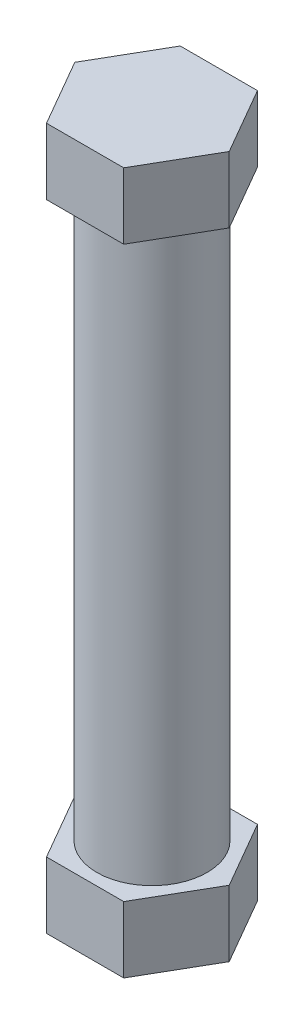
ISO-10303-21;
HEADER;
FILE_DESCRIPTION(('STEP AP214'),'2;1');
FILE_NAME('part.step','',(''),(''),'','','');
FILE_SCHEMA(('AUTOMOTIVE_DESIGN { 1 0 10303 214 1 1 1 1 }'));
ENDSEC;
DATA;
#1=APPLICATION_CONTEXT('core data for automotive mechanical design processes');
#2=APPLICATION_PROTOCOL_DEFINITION('international standard','automotive_design',2000,#1);
#3=PRODUCT_CONTEXT('',#1,'mechanical');
#4=PRODUCT('Part','Part','',(#3));
#5=PRODUCT_RELATED_PRODUCT_CATEGORY('part','',(#4));
#6=PRODUCT_DEFINITION_FORMATION('','',#4);
#7=PRODUCT_DEFINITION_CONTEXT('part definition',#1,'design');
#8=PRODUCT_DEFINITION('design','',#6,#7);
#9=PRODUCT_DEFINITION_SHAPE('','',#8);
#10=(LENGTH_UNIT() NAMED_UNIT(*) SI_UNIT(.MILLI.,.METRE.));
#11=(NAMED_UNIT(*) PLANE_ANGLE_UNIT() SI_UNIT($,.RADIAN.));
#12=(NAMED_UNIT(*) SI_UNIT($,.STERADIAN.) SOLID_ANGLE_UNIT());
#13=UNCERTAINTY_MEASURE_WITH_UNIT(LENGTH_MEASURE(1.E-05),#10,'distance_accuracy_value','');
#14=(GEOMETRIC_REPRESENTATION_CONTEXT(3) GLOBAL_UNCERTAINTY_ASSIGNED_CONTEXT((#13)) GLOBAL_UNIT_ASSIGNED_CONTEXT((#10,
#11,#12)) REPRESENTATION_CONTEXT('',''));
#15=CARTESIAN_POINT('',(0.,0.,0.));
#16=DIRECTION('',(0.,0.,1.));
#17=DIRECTION('',(1.,0.,0.));
#18=AXIS2_PLACEMENT_3D('',#15,#16,#17);
#19=CARTESIAN_POINT('',(0.,16.383,0.));
#20=DIRECTION('',(0.,-1.,0.));
#21=DIRECTION('',(0.,0.,-1.));
#22=AXIS2_PLACEMENT_3D('',#19,#20,#21);
#23=CYLINDRICAL_SURFACE('',#22,3.175);
#24=CARTESIAN_POINT('',(0.,16.383,0.));
#25=DIRECTION('',(0.,1.,0.));
#26=DIRECTION('',(0.,0.,1.));
#27=AXIS2_PLACEMENT_3D('',#24,#25,#26);
#28=CIRCLE('',#27,3.175);
#29=CARTESIAN_POINT('',(0.,16.383,3.175));
#30=VERTEX_POINT('',#29);
#31=EDGE_CURVE('E11',#30,#30,#28,.T.);
#32=ORIENTED_EDGE('',*,*,#31,.F.);
#33=EDGE_LOOP('',(#32));
#34=FACE_BOUND('',#33,.T.);
#35=CARTESIAN_POINT('',(0.,-16.383,0.));
#36=DIRECTION('',(0.,1.,0.));
#37=DIRECTION('',(0.,0.,1.));
#38=AXIS2_PLACEMENT_3D('',#35,#36,#37);
#39=CIRCLE('',#38,3.175);
#40=CARTESIAN_POINT('',(0.,-16.383,3.175));
#41=VERTEX_POINT('',#40);
#42=EDGE_CURVE('E46',#41,#41,#39,.T.);
#43=ORIENTED_EDGE('',*,*,#42,.T.);
#44=EDGE_LOOP('',(#43));
#45=FACE_BOUND('',#44,.T.);
#46=ADVANCED_FACE('F43',(#34,#45),#23,.T.);
#47=CARTESIAN_POINT('',(4.445,20.193,0.));
#48=DIRECTION('',(-0.866025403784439,0.,0.5));
#49=DIRECTION('',(0.5,0.,0.866025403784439));
#50=AXIS2_PLACEMENT_3D('',#47,#48,#49);
#51=PLANE('',#50);
#52=DIRECTION('',(-0.5,0.,-0.866025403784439));
#53=VECTOR('',#52,1.);
#54=CARTESIAN_POINT('',(4.445,16.383,0.));
#55=LINE('',#54,#53);
#56=CARTESIAN_POINT('',(4.445,16.383,0.));
#57=VERTEX_POINT('',#56);
#58=CARTESIAN_POINT('',(2.2225,16.383,-3.84948291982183));
#59=VERTEX_POINT('',#58);
#60=EDGE_CURVE('E133',#57,#59,#55,.T.);
#61=ORIENTED_EDGE('',*,*,#60,.T.);
#62=DIRECTION('',(0.,-1.,0.));
#63=VECTOR('',#62,1.);
#64=CARTESIAN_POINT('',(2.2225,20.193,-3.84948291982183));
#65=LINE('',#64,#63);
#66=CARTESIAN_POINT('',(2.2225,20.193,-3.84948291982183));
#67=VERTEX_POINT('',#66);
#68=EDGE_CURVE('E52',#67,#59,#65,.T.);
#69=ORIENTED_EDGE('',*,*,#68,.F.);
#70=DIRECTION('',(-0.5,0.,-0.866025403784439));
#71=VECTOR('',#70,1.);
#72=CARTESIAN_POINT('',(4.445,20.193,0.));
#73=LINE('',#72,#71);
#74=CARTESIAN_POINT('',(4.445,20.193,0.));
#75=VERTEX_POINT('',#74);
#76=EDGE_CURVE('E143',#75,#67,#73,.T.);
#77=ORIENTED_EDGE('',*,*,#76,.F.);
#78=DIRECTION('',(0.,-1.,0.));
#79=VECTOR('',#78,1.);
#80=CARTESIAN_POINT('',(4.445,20.193,0.));
#81=LINE('',#80,#79);
#82=EDGE_CURVE('E129',#75,#57,#81,.T.);
#83=ORIENTED_EDGE('',*,*,#82,.T.);
#84=EDGE_LOOP('',(#61,#69,#77,#83));
#85=FACE_BOUND('',#84,.T.);
#86=ADVANCED_FACE('F155',(#85),#51,.F.);
#87=CARTESIAN_POINT('',(2.2225,20.193,-3.84948291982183));
#88=DIRECTION('',(0.,0.,1.));
#89=DIRECTION('',(1.,0.,0.));
#90=AXIS2_PLACEMENT_3D('',#87,#88,#89);
#91=PLANE('',#90);
#92=DIRECTION('',(-1.,0.,0.));
#93=VECTOR('',#92,1.);
#94=CARTESIAN_POINT('',(2.2225,16.383,-3.84948291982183));
#95=LINE('',#94,#93);
#96=CARTESIAN_POINT('',(-2.2225,16.383,-3.84948291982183));
#97=VERTEX_POINT('',#96);
#98=EDGE_CURVE('E136',#59,#97,#95,.T.);
#99=ORIENTED_EDGE('',*,*,#98,.T.);
#100=DIRECTION('',(0.,-1.,0.));
#101=VECTOR('',#100,1.);
#102=CARTESIAN_POINT('',(-2.2225,20.193,-3.84948291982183));
#103=LINE('',#102,#101);
#104=CARTESIAN_POINT('',(-2.2225,20.193,-3.84948291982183));
#105=VERTEX_POINT('',#104);
#106=EDGE_CURVE('E147',#105,#97,#103,.T.);
#107=ORIENTED_EDGE('',*,*,#106,.F.);
#108=DIRECTION('',(-1.,0.,0.));
#109=VECTOR('',#108,1.);
#110=CARTESIAN_POINT('',(2.2225,20.193,-3.84948291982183));
#111=LINE('',#110,#109);
#112=EDGE_CURVE('E99',#67,#105,#111,.T.);
#113=ORIENTED_EDGE('',*,*,#112,.F.);
#114=ORIENTED_EDGE('',*,*,#68,.T.);
#115=EDGE_LOOP('',(#99,#107,#113,#114));
#116=FACE_BOUND('',#115,.T.);
#117=ADVANCED_FACE('F151',(#116),#91,.F.);
#118=CARTESIAN_POINT('',(-2.2225,20.193,-3.84948291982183));
#119=DIRECTION('',(0.866025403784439,0.,0.5));
#120=DIRECTION('',(0.5,0.,-0.866025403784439));
#121=AXIS2_PLACEMENT_3D('',#118,#119,#120);
#122=PLANE('',#121);
#123=DIRECTION('',(-0.5,0.,0.866025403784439));
#124=VECTOR('',#123,1.);
#125=CARTESIAN_POINT('',(-2.2225,16.383,-3.84948291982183));
#126=LINE('',#125,#124);
#127=CARTESIAN_POINT('',(-4.445,16.383,0.));
#128=VERTEX_POINT('',#127);
#129=EDGE_CURVE('E138',#97,#128,#126,.T.);
#130=ORIENTED_EDGE('',*,*,#129,.T.);
#131=DIRECTION('',(0.,-1.,0.));
#132=VECTOR('',#131,1.);
#133=CARTESIAN_POINT('',(-4.445,20.193,0.));
#134=LINE('',#133,#132);
#135=CARTESIAN_POINT('',(-4.445,20.193,0.));
#136=VERTEX_POINT('',#135);
#137=EDGE_CURVE('E124',#136,#128,#134,.T.);
#138=ORIENTED_EDGE('',*,*,#137,.F.);
#139=DIRECTION('',(-0.5,0.,0.866025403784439));
#140=VECTOR('',#139,1.);
#141=CARTESIAN_POINT('',(-2.2225,20.193,-3.84948291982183));
#142=LINE('',#141,#140);
#143=EDGE_CURVE('E115',#105,#136,#142,.T.);
#144=ORIENTED_EDGE('',*,*,#143,.F.);
#145=ORIENTED_EDGE('',*,*,#106,.T.);
#146=EDGE_LOOP('',(#130,#138,#144,#145));
#147=FACE_BOUND('',#146,.T.);
#148=ADVANCED_FACE('F160',(#147),#122,.F.);
#149=CARTESIAN_POINT('',(-4.445,20.193,0.));
#150=DIRECTION('',(0.866025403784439,0.,-0.5));
#151=DIRECTION('',(-0.5,0.,-0.866025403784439));
#152=AXIS2_PLACEMENT_3D('',#149,#150,#151);
#153=PLANE('',#152);
#154=DIRECTION('',(0.5,0.,0.866025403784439));
#155=VECTOR('',#154,1.);
#156=CARTESIAN_POINT('',(-4.445,16.383,0.));
#157=LINE('',#156,#155);
#158=CARTESIAN_POINT('',(-2.2225,16.383,3.84948291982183));
#159=VERTEX_POINT('',#158);
#160=EDGE_CURVE('E123',#128,#159,#157,.T.);
#161=ORIENTED_EDGE('',*,*,#160,.T.);
#162=DIRECTION('',(0.,-1.,0.));
#163=VECTOR('',#162,1.);
#164=CARTESIAN_POINT('',(-2.2225,20.193,3.84948291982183));
#165=LINE('',#164,#163);
#166=CARTESIAN_POINT('',(-2.2225,20.193,3.84948291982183));
#167=VERTEX_POINT('',#166);
#168=EDGE_CURVE('E120',#167,#159,#165,.T.);
#169=ORIENTED_EDGE('',*,*,#168,.F.);
#170=DIRECTION('',(0.5,0.,0.866025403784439));
#171=VECTOR('',#170,1.);
#172=CARTESIAN_POINT('',(-4.445,20.193,0.));
#173=LINE('',#172,#171);
#174=EDGE_CURVE('E109',#136,#167,#173,.T.);
#175=ORIENTED_EDGE('',*,*,#174,.F.);
#176=ORIENTED_EDGE('',*,*,#137,.T.);
#177=EDGE_LOOP('',(#161,#169,#175,#176));
#178=FACE_BOUND('',#177,.T.);
#179=ADVANCED_FACE('F121',(#178),#153,.F.);
#180=CARTESIAN_POINT('',(-2.2225,20.193,3.84948291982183));
#181=DIRECTION('',(0.,0.,-1.));
#182=DIRECTION('',(-1.,0.,0.));
#183=AXIS2_PLACEMENT_3D('',#180,#181,#182);
#184=PLANE('',#183);
#185=DIRECTION('',(1.,0.,0.));
#186=VECTOR('',#185,1.);
#187=CARTESIAN_POINT('',(-2.2225,16.383,3.84948291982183));
#188=LINE('',#187,#186);
#189=CARTESIAN_POINT('',(2.2225,16.383,3.84948291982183));
#190=VERTEX_POINT('',#189);
#191=EDGE_CURVE('E84',#159,#190,#188,.T.);
#192=ORIENTED_EDGE('',*,*,#191,.T.);
#193=DIRECTION('',(0.,-1.,0.));
#194=VECTOR('',#193,1.);
#195=CARTESIAN_POINT('',(2.2225,20.193,3.84948291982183));
#196=LINE('',#195,#194);
#197=CARTESIAN_POINT('',(2.2225,20.193,3.84948291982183));
#198=VERTEX_POINT('',#197);
#199=EDGE_CURVE('E125',#198,#190,#196,.T.);
#200=ORIENTED_EDGE('',*,*,#199,.F.);
#201=DIRECTION('',(1.,0.,0.));
#202=VECTOR('',#201,1.);
#203=CARTESIAN_POINT('',(-2.2225,20.193,3.84948291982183));
#204=LINE('',#203,#202);
#205=EDGE_CURVE('E113',#167,#198,#204,.T.);
#206=ORIENTED_EDGE('',*,*,#205,.F.);
#207=ORIENTED_EDGE('',*,*,#168,.T.);
#208=EDGE_LOOP('',(#192,#200,#206,#207));
#209=FACE_BOUND('',#208,.T.);
#210=ADVANCED_FACE('F127',(#209),#184,.F.);
#211=CARTESIAN_POINT('',(2.2225,20.193,3.84948291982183));
#212=DIRECTION('',(-0.866025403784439,0.,-0.5));
#213=DIRECTION('',(-0.5,0.,0.866025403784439));
#214=AXIS2_PLACEMENT_3D('',#211,#212,#213);
#215=PLANE('',#214);
#216=DIRECTION('',(0.5,0.,-0.866025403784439));
#217=VECTOR('',#216,1.);
#218=CARTESIAN_POINT('',(2.2225,16.383,3.84948291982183));
#219=LINE('',#218,#217);
#220=EDGE_CURVE('E90',#190,#57,#219,.T.);
#221=ORIENTED_EDGE('',*,*,#220,.T.);
#222=ORIENTED_EDGE('',*,*,#82,.F.);
#223=DIRECTION('',(0.5,0.,-0.866025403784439));
#224=VECTOR('',#223,1.);
#225=CARTESIAN_POINT('',(2.2225,20.193,3.84948291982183));
#226=LINE('',#225,#224);
#227=EDGE_CURVE('E60',#198,#75,#226,.T.);
#228=ORIENTED_EDGE('',*,*,#227,.F.);
#229=ORIENTED_EDGE('',*,*,#199,.T.);
#230=EDGE_LOOP('',(#221,#222,#228,#229));
#231=FACE_BOUND('',#230,.T.);
#232=ADVANCED_FACE('F361',(#231),#215,.F.);
#233=CARTESIAN_POINT('',(0.,20.193,0.));
#234=DIRECTION('',(0.,1.,0.));
#235=DIRECTION('',(0.,0.,1.));
#236=AXIS2_PLACEMENT_3D('',#233,#234,#235);
#237=PLANE('',#236);
#238=ORIENTED_EDGE('',*,*,#76,.T.);
#239=ORIENTED_EDGE('',*,*,#112,.T.);
#240=ORIENTED_EDGE('',*,*,#143,.T.);
#241=ORIENTED_EDGE('',*,*,#174,.T.);
#242=ORIENTED_EDGE('',*,*,#205,.T.);
#243=ORIENTED_EDGE('',*,*,#227,.T.);
#244=EDGE_LOOP('',(#238,#239,#240,#241,#242,#243));
#245=FACE_BOUND('',#244,.T.);
#246=ADVANCED_FACE('F111',(#245),#237,.T.);
#247=CARTESIAN_POINT('',(0.,16.383,0.));
#248=DIRECTION('',(0.,1.,0.));
#249=DIRECTION('',(0.,0.,1.));
#250=AXIS2_PLACEMENT_3D('',#247,#248,#249);
#251=PLANE('',#250);
#252=ORIENTED_EDGE('',*,*,#31,.T.);
#253=EDGE_LOOP('',(#252));
#254=FACE_BOUND('',#253,.T.);
#255=ORIENTED_EDGE('',*,*,#60,.F.);
#256=ORIENTED_EDGE('',*,*,#220,.F.);
#257=ORIENTED_EDGE('',*,*,#191,.F.);
#258=ORIENTED_EDGE('',*,*,#160,.F.);
#259=ORIENTED_EDGE('',*,*,#129,.F.);
#260=ORIENTED_EDGE('',*,*,#98,.F.);
#261=EDGE_LOOP('',(#255,#256,#257,#258,#259,#260));
#262=FACE_BOUND('',#261,.T.);
#263=ADVANCED_FACE('F157',(#254,#262),#251,.F.);
#264=CARTESIAN_POINT('',(4.445,-20.193,0.));
#265=DIRECTION('',(0.866025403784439,0.,-0.5));
#266=DIRECTION('',(-0.5,0.,-0.866025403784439));
#267=AXIS2_PLACEMENT_3D('',#264,#265,#266);
#268=PLANE('',#267);
#269=DIRECTION('',(-0.5,0.,-0.866025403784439));
#270=VECTOR('',#269,1.);
#271=CARTESIAN_POINT('',(4.445,-16.383,0.));
#272=LINE('',#271,#270);
#273=CARTESIAN_POINT('',(4.445,-16.383,0.));
#274=VERTEX_POINT('',#273);
#275=CARTESIAN_POINT('',(2.2225,-16.383,-3.84948291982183));
#276=VERTEX_POINT('',#275);
#277=EDGE_CURVE('E199',#274,#276,#272,.T.);
#278=ORIENTED_EDGE('',*,*,#277,.F.);
#279=DIRECTION('',(0.,1.,0.));
#280=VECTOR('',#279,1.);
#281=CARTESIAN_POINT('',(4.445,-20.193,0.));
#282=LINE('',#281,#280);
#283=CARTESIAN_POINT('',(4.445,-20.193,0.));
#284=VERTEX_POINT('',#283);
#285=EDGE_CURVE('E164',#284,#274,#282,.T.);
#286=ORIENTED_EDGE('',*,*,#285,.F.);
#287=DIRECTION('',(-0.5,0.,-0.866025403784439));
#288=VECTOR('',#287,1.);
#289=CARTESIAN_POINT('',(4.445,-20.193,0.));
#290=LINE('',#289,#288);
#291=CARTESIAN_POINT('',(2.2225,-20.193,-3.84948291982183));
#292=VERTEX_POINT('',#291);
#293=EDGE_CURVE('E186',#284,#292,#290,.T.);
#294=ORIENTED_EDGE('',*,*,#293,.T.);
#295=DIRECTION('',(0.,1.,0.));
#296=VECTOR('',#295,1.);
#297=CARTESIAN_POINT('',(2.2225,-20.193,-3.84948291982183));
#298=LINE('',#297,#296);
#299=EDGE_CURVE('E179',#292,#276,#298,.T.);
#300=ORIENTED_EDGE('',*,*,#299,.T.);
#301=EDGE_LOOP('',(#278,#286,#294,#300));
#302=FACE_BOUND('',#301,.T.);
#303=ADVANCED_FACE('F222',(#302),#268,.T.);
#304=CARTESIAN_POINT('',(2.2225,-20.193,3.84948291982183));
#305=DIRECTION('',(0.866025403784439,0.,0.5));
#306=DIRECTION('',(0.5,0.,-0.866025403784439));
#307=AXIS2_PLACEMENT_3D('',#304,#305,#306);
#308=PLANE('',#307);
#309=DIRECTION('',(0.5,0.,-0.866025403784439));
#310=VECTOR('',#309,1.);
#311=CARTESIAN_POINT('',(2.2225,-16.383,3.84948291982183));
#312=LINE('',#311,#310);
#313=CARTESIAN_POINT('',(2.2225,-16.383,3.84948291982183));
#314=VERTEX_POINT('',#313);
#315=EDGE_CURVE('E196',#314,#274,#312,.T.);
#316=ORIENTED_EDGE('',*,*,#315,.F.);
#317=DIRECTION('',(0.,1.,0.));
#318=VECTOR('',#317,1.);
#319=CARTESIAN_POINT('',(2.2225,-20.193,3.84948291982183));
#320=LINE('',#319,#318);
#321=CARTESIAN_POINT('',(2.2225,-20.193,3.84948291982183));
#322=VERTEX_POINT('',#321);
#323=EDGE_CURVE('E167',#322,#314,#320,.T.);
#324=ORIENTED_EDGE('',*,*,#323,.F.);
#325=DIRECTION('',(0.5,0.,-0.866025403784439));
#326=VECTOR('',#325,1.);
#327=CARTESIAN_POINT('',(2.2225,-20.193,3.84948291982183));
#328=LINE('',#327,#326);
#329=EDGE_CURVE('E213',#322,#284,#328,.T.);
#330=ORIENTED_EDGE('',*,*,#329,.T.);
#331=ORIENTED_EDGE('',*,*,#285,.T.);
#332=EDGE_LOOP('',(#316,#324,#330,#331));
#333=FACE_BOUND('',#332,.T.);
#334=ADVANCED_FACE('F270',(#333),#308,.T.);
#335=CARTESIAN_POINT('',(-2.2225,-20.193,3.84948291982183));
#336=DIRECTION('',(0.,0.,1.));
#337=DIRECTION('',(1.,0.,0.));
#338=AXIS2_PLACEMENT_3D('',#335,#336,#337);
#339=PLANE('',#338);
#340=DIRECTION('',(1.,0.,0.));
#341=VECTOR('',#340,1.);
#342=CARTESIAN_POINT('',(-2.2225,-16.383,3.84948291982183));
#343=LINE('',#342,#341);
#344=CARTESIAN_POINT('',(-2.2225,-16.383,3.84948291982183));
#345=VERTEX_POINT('',#344);
#346=EDGE_CURVE('E193',#345,#314,#343,.T.);
#347=ORIENTED_EDGE('',*,*,#346,.F.);
#348=DIRECTION('',(0.,1.,0.));
#349=VECTOR('',#348,1.);
#350=CARTESIAN_POINT('',(-2.2225,-20.193,3.84948291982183));
#351=LINE('',#350,#349);
#352=CARTESIAN_POINT('',(-2.2225,-20.193,3.84948291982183));
#353=VERTEX_POINT('',#352);
#354=EDGE_CURVE('E170',#353,#345,#351,.T.);
#355=ORIENTED_EDGE('',*,*,#354,.F.);
#356=DIRECTION('',(1.,0.,0.));
#357=VECTOR('',#356,1.);
#358=CARTESIAN_POINT('',(-2.2225,-20.193,3.84948291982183));
#359=LINE('',#358,#357);
#360=EDGE_CURVE('E210',#353,#322,#359,.T.);
#361=ORIENTED_EDGE('',*,*,#360,.T.);
#362=ORIENTED_EDGE('',*,*,#323,.T.);
#363=EDGE_LOOP('',(#347,#355,#361,#362));
#364=FACE_BOUND('',#363,.T.);
#365=ADVANCED_FACE('F261',(#364),#339,.T.);
#366=CARTESIAN_POINT('',(-4.445,-20.193,0.));
#367=DIRECTION('',(-0.866025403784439,0.,0.5));
#368=DIRECTION('',(0.5,0.,0.866025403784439));
#369=AXIS2_PLACEMENT_3D('',#366,#367,#368);
#370=PLANE('',#369);
#371=DIRECTION('',(0.5,0.,0.866025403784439));
#372=VECTOR('',#371,1.);
#373=CARTESIAN_POINT('',(-4.445,-16.383,0.));
#374=LINE('',#373,#372);
#375=CARTESIAN_POINT('',(-4.445,-16.383,0.));
#376=VERTEX_POINT('',#375);
#377=EDGE_CURVE('E190',#376,#345,#374,.T.);
#378=ORIENTED_EDGE('',*,*,#377,.F.);
#379=DIRECTION('',(0.,1.,0.));
#380=VECTOR('',#379,1.);
#381=CARTESIAN_POINT('',(-4.445,-20.193,0.));
#382=LINE('',#381,#380);
#383=CARTESIAN_POINT('',(-4.445,-20.193,0.));
#384=VERTEX_POINT('',#383);
#385=EDGE_CURVE('E173',#384,#376,#382,.T.);
#386=ORIENTED_EDGE('',*,*,#385,.F.);
#387=DIRECTION('',(0.5,0.,0.866025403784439));
#388=VECTOR('',#387,1.);
#389=CARTESIAN_POINT('',(-4.445,-20.193,0.));
#390=LINE('',#389,#388);
#391=EDGE_CURVE('E207',#384,#353,#390,.T.);
#392=ORIENTED_EDGE('',*,*,#391,.T.);
#393=ORIENTED_EDGE('',*,*,#354,.T.);
#394=EDGE_LOOP('',(#378,#386,#392,#393));
#395=FACE_BOUND('',#394,.T.);
#396=ADVANCED_FACE('F264',(#395),#370,.T.);
#397=CARTESIAN_POINT('',(-2.2225,-20.193,-3.84948291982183));
#398=DIRECTION('',(-0.866025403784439,0.,-0.5));
#399=DIRECTION('',(-0.5,0.,0.866025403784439));
#400=AXIS2_PLACEMENT_3D('',#397,#398,#399);
#401=PLANE('',#400);
#402=DIRECTION('',(-0.5,0.,0.866025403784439));
#403=VECTOR('',#402,1.);
#404=CARTESIAN_POINT('',(-2.2225,-16.383,-3.84948291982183));
#405=LINE('',#404,#403);
#406=CARTESIAN_POINT('',(-2.2225,-16.383,-3.84948291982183));
#407=VERTEX_POINT('',#406);
#408=EDGE_CURVE('E187',#407,#376,#405,.T.);
#409=ORIENTED_EDGE('',*,*,#408,.F.);
#410=DIRECTION('',(0.,1.,0.));
#411=VECTOR('',#410,1.);
#412=CARTESIAN_POINT('',(-2.2225,-20.193,-3.84948291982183));
#413=LINE('',#412,#411);
#414=CARTESIAN_POINT('',(-2.2225,-20.193,-3.84948291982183));
#415=VERTEX_POINT('',#414);
#416=EDGE_CURVE('E176',#415,#407,#413,.T.);
#417=ORIENTED_EDGE('',*,*,#416,.F.);
#418=DIRECTION('',(-0.5,0.,0.866025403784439));
#419=VECTOR('',#418,1.);
#420=CARTESIAN_POINT('',(-2.2225,-20.193,-3.84948291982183));
#421=LINE('',#420,#419);
#422=EDGE_CURVE('E204',#415,#384,#421,.T.);
#423=ORIENTED_EDGE('',*,*,#422,.T.);
#424=ORIENTED_EDGE('',*,*,#385,.T.);
#425=EDGE_LOOP('',(#409,#417,#423,#424));
#426=FACE_BOUND('',#425,.T.);
#427=ADVANCED_FACE('F265',(#426),#401,.T.);
#428=CARTESIAN_POINT('',(2.2225,-20.193,-3.84948291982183));
#429=DIRECTION('',(0.,0.,-1.));
#430=DIRECTION('',(-1.,0.,0.));
#431=AXIS2_PLACEMENT_3D('',#428,#429,#430);
#432=PLANE('',#431);
#433=DIRECTION('',(-1.,0.,0.));
#434=VECTOR('',#433,1.);
#435=CARTESIAN_POINT('',(2.2225,-16.383,-3.84948291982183));
#436=LINE('',#435,#434);
#437=EDGE_CURVE('E183',#276,#407,#436,.T.);
#438=ORIENTED_EDGE('',*,*,#437,.F.);
#439=ORIENTED_EDGE('',*,*,#299,.F.);
#440=DIRECTION('',(-1.,0.,0.));
#441=VECTOR('',#440,1.);
#442=CARTESIAN_POINT('',(2.2225,-20.193,-3.84948291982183));
#443=LINE('',#442,#441);
#444=EDGE_CURVE('E182',#292,#415,#443,.T.);
#445=ORIENTED_EDGE('',*,*,#444,.T.);
#446=ORIENTED_EDGE('',*,*,#416,.T.);
#447=EDGE_LOOP('',(#438,#439,#445,#446));
#448=FACE_BOUND('',#447,.T.);
#449=ADVANCED_FACE('F234',(#448),#432,.T.);
#450=CARTESIAN_POINT('',(0.,-20.193,0.));
#451=DIRECTION('',(0.,-1.,0.));
#452=DIRECTION('',(0.,0.,1.));
#453=AXIS2_PLACEMENT_3D('',#450,#451,#452);
#454=PLANE('',#453);
#455=ORIENTED_EDGE('',*,*,#293,.F.);
#456=ORIENTED_EDGE('',*,*,#329,.F.);
#457=ORIENTED_EDGE('',*,*,#360,.F.);
#458=ORIENTED_EDGE('',*,*,#391,.F.);
#459=ORIENTED_EDGE('',*,*,#422,.F.);
#460=ORIENTED_EDGE('',*,*,#444,.F.);
#461=EDGE_LOOP('',(#455,#456,#457,#458,#459,#460));
#462=FACE_BOUND('',#461,.T.);
#463=ADVANCED_FACE('F230',(#462),#454,.T.);
#464=CARTESIAN_POINT('',(0.,-16.383,0.));
#465=DIRECTION('',(0.,-1.,0.));
#466=DIRECTION('',(0.,0.,1.));
#467=AXIS2_PLACEMENT_3D('',#464,#465,#466);
#468=PLANE('',#467);
#469=ORIENTED_EDGE('',*,*,#42,.F.);
#470=EDGE_LOOP('',(#469));
#471=FACE_BOUND('',#470,.T.);
#472=ORIENTED_EDGE('',*,*,#277,.T.);
#473=ORIENTED_EDGE('',*,*,#437,.T.);
#474=ORIENTED_EDGE('',*,*,#408,.T.);
#475=ORIENTED_EDGE('',*,*,#377,.T.);
#476=ORIENTED_EDGE('',*,*,#346,.T.);
#477=ORIENTED_EDGE('',*,*,#315,.T.);
#478=EDGE_LOOP('',(#472,#473,#474,#475,#476,#477));
#479=FACE_BOUND('',#478,.T.);
#480=ADVANCED_FACE('F267',(#471,#479),#468,.F.);
#481=CLOSED_SHELL('',(#46,#86,#117,#148,#179,#210,#232,#246,#263,#303,#334,#365,#396,#427,#449,
#463,#480));
#482=MANIFOLD_SOLID_BREP('B2',#481);
#483=ADVANCED_BREP_SHAPE_REPRESENTATION('',(#18,#482),#14);
#484=SHAPE_DEFINITION_REPRESENTATION(#9,#483);
ENDSEC;
END-ISO-10303-21;
